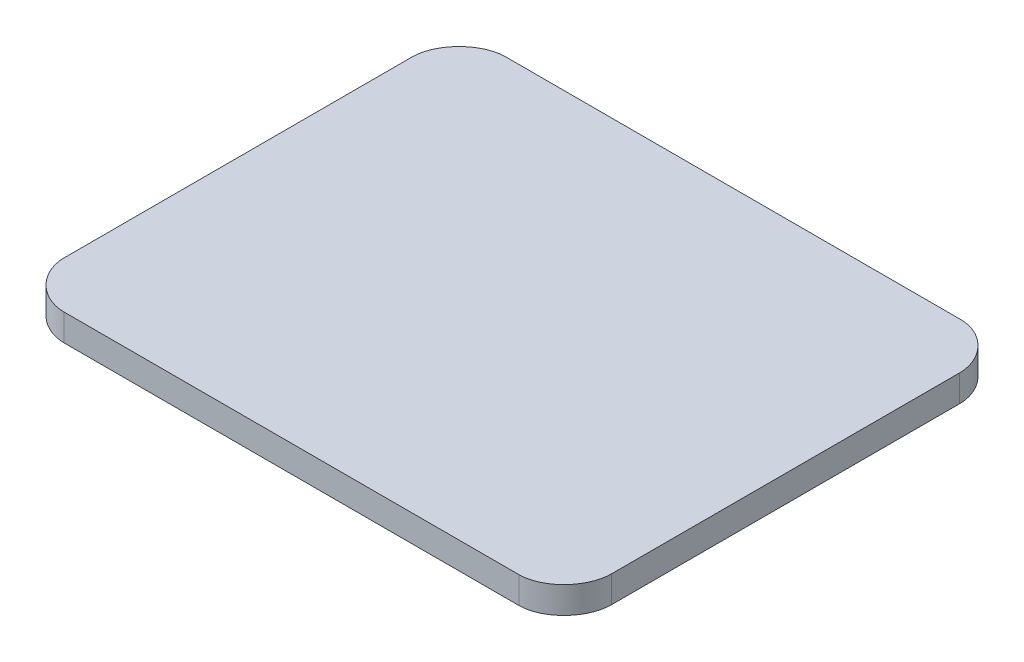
ISO-10303-21;
HEADER;
FILE_DESCRIPTION(('STEP AP214'),'2;1');
FILE_NAME('part.step','',(''),(''),'','','');
FILE_SCHEMA(('AUTOMOTIVE_DESIGN { 1 0 10303 214 1 1 1 1 }'));
ENDSEC;
DATA;
#1=APPLICATION_CONTEXT('core data for automotive mechanical design processes');
#2=APPLICATION_PROTOCOL_DEFINITION('international standard','automotive_design',2000,#1);
#3=PRODUCT_CONTEXT('',#1,'mechanical');
#4=PRODUCT('Part','Part','',(#3));
#5=PRODUCT_RELATED_PRODUCT_CATEGORY('part','',(#4));
#6=PRODUCT_DEFINITION_FORMATION('','',#4);
#7=PRODUCT_DEFINITION_CONTEXT('part definition',#1,'design');
#8=PRODUCT_DEFINITION('design','',#6,#7);
#9=PRODUCT_DEFINITION_SHAPE('','',#8);
#10=(LENGTH_UNIT() NAMED_UNIT(*) SI_UNIT(.MILLI.,.METRE.));
#11=(NAMED_UNIT(*) PLANE_ANGLE_UNIT() SI_UNIT($,.RADIAN.));
#12=(NAMED_UNIT(*) SI_UNIT($,.STERADIAN.) SOLID_ANGLE_UNIT());
#13=UNCERTAINTY_MEASURE_WITH_UNIT(LENGTH_MEASURE(1.E-05),#10,'distance_accuracy_value','');
#14=(GEOMETRIC_REPRESENTATION_CONTEXT(3) GLOBAL_UNCERTAINTY_ASSIGNED_CONTEXT((#13)) GLOBAL_UNIT_ASSIGNED_CONTEXT((#10,
#11,#12)) REPRESENTATION_CONTEXT('',''));
#15=CARTESIAN_POINT('',(0.,0.,0.));
#16=DIRECTION('',(0.,0.,1.));
#17=DIRECTION('',(1.,0.,0.));
#18=AXIS2_PLACEMENT_3D('',#15,#16,#17);
#19=CARTESIAN_POINT('',(-137.,-36.999,-42.4815439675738));
#20=CARTESIAN_POINT('',(-138.817475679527,-36.999,-42.4815439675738));
#21=CARTESIAN_POINT('',(-140.51763192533,-36.999,-44.1822833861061));
#22=CARTESIAN_POINT('',(-140.517631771,-36.999,-46.0005617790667));
#23=B_SPLINE_CURVE_WITH_KNOTS('',3,(#19,#20,#21,#22),.UNSPECIFIED.,.F.,.F.,(4,4),(0.,1.),.UNSPECIFIED.);
#24=DIRECTION('',(0.,-1.,0.));
#25=VECTOR('',#24,1.);
#26=SURFACE_OF_LINEAR_EXTRUSION('',#23,#25);
#27=CARTESIAN_POINT('',(-137.,-38.999,-42.4815439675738));
#28=CARTESIAN_POINT('',(-138.817475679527,-38.999,-42.4815439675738));
#29=CARTESIAN_POINT('',(-140.51763192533,-38.999,-44.1822833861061));
#30=CARTESIAN_POINT('',(-140.517631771,-38.999,-46.0005617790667));
#31=B_SPLINE_CURVE_WITH_KNOTS('',3,(#27,#28,#29,#30),.UNSPECIFIED.,.F.,.F.,(4,4),(0.,1.),.UNSPECIFIED.);
#32=CARTESIAN_POINT('',(-137.,-38.999,-42.4815439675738));
#33=VERTEX_POINT('',#32);
#34=CARTESIAN_POINT('',(-140.517631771,-38.999,-46.0005617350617));
#35=VERTEX_POINT('',#34);
#36=EDGE_CURVE('E256',#33,#35,#31,.T.);
#37=ORIENTED_EDGE('',*,*,#36,.F.);
#38=CARTESIAN_POINT('',(-137.,-38.999,-42.4815439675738));
#39=DIRECTION('',(0.,1.,0.));
#40=VECTOR('',#39,1.);
#41=LINE('',#38,#40);
#42=CARTESIAN_POINT('',(-137.,-36.999,-42.4815439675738));
#43=VERTEX_POINT('',#42);
#44=EDGE_CURVE('E37',#43,#33,#41,.F.);
#45=ORIENTED_EDGE('',*,*,#44,.F.);
#46=CARTESIAN_POINT('',(-140.517631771,-36.999,-46.0005617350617));
#47=VERTEX_POINT('',#46);
#48=EDGE_CURVE('E257',#43,#47,#23,.T.);
#49=ORIENTED_EDGE('',*,*,#48,.T.);
#50=CARTESIAN_POINT('',(-140.517631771,-36.999,-46.0005617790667));
#51=DIRECTION('',(0.,-1.,0.));
#52=VECTOR('',#51,1.);
#53=LINE('',#50,#52);
#54=EDGE_CURVE('E11',#47,#35,#53,.T.);
#55=ORIENTED_EDGE('',*,*,#54,.T.);
#56=EDGE_LOOP('',(#37,#45,#49,#55));
#57=FACE_BOUND('',#56,.T.);
#58=ADVANCED_FACE('F17',(#57),#26,.T.);
#59=CARTESIAN_POINT('',(-140.517631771,-36.999,-46.0005617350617));
#60=DIRECTION('',(-1.,0.,0.));
#61=DIRECTION('',(0.,0.,1.));
#62=AXIS2_PLACEMENT_3D('',#59,#60,#61);
#63=PLANE('',#62);
#64=DIRECTION('',(0.,0.,-1.));
#65=VECTOR('',#64,1.);
#66=CARTESIAN_POINT('',(-140.517631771,-38.999,-46.0005617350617));
#67=LINE('',#66,#65);
#68=CARTESIAN_POINT('',(-140.517631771,-38.999,-71.9994377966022));
#69=VERTEX_POINT('',#68);
#70=EDGE_CURVE('E259',#35,#69,#67,.T.);
#71=ORIENTED_EDGE('',*,*,#70,.F.);
#72=ORIENTED_EDGE('',*,*,#54,.F.);
#73=DIRECTION('',(0.,0.,-1.));
#74=VECTOR('',#73,1.);
#75=CARTESIAN_POINT('',(-140.517631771,-36.999,-46.0005617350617));
#76=LINE('',#75,#74);
#77=CARTESIAN_POINT('',(-140.517631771,-36.999,-71.9994377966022));
#78=VERTEX_POINT('',#77);
#79=EDGE_CURVE('E333',#47,#78,#76,.T.);
#80=ORIENTED_EDGE('',*,*,#79,.T.);
#81=CARTESIAN_POINT('',(-140.517631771,-38.999,-71.9994377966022));
#82=DIRECTION('',(0.,1.,0.));
#83=VECTOR('',#82,1.);
#84=LINE('',#81,#83);
#85=EDGE_CURVE('E29',#78,#69,#84,.F.);
#86=ORIENTED_EDGE('',*,*,#85,.T.);
#87=EDGE_LOOP('',(#71,#72,#80,#86));
#88=FACE_BOUND('',#87,.T.);
#89=ADVANCED_FACE('F220',(#88),#63,.T.);
#90=CARTESIAN_POINT('',(-140.517631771,-36.999,-71.9994377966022));
#91=CARTESIAN_POINT('',(-140.517631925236,-36.999,-73.8166049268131));
#92=CARTESIAN_POINT('',(-138.818587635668,-36.999,-75.518456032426));
#93=CARTESIAN_POINT('',(-137.,-36.999,-75.518456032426));
#94=B_SPLINE_CURVE_WITH_KNOTS('',3,(#90,#91,#92,#93),.UNSPECIFIED.,.F.,.F.,(4,4),(0.,1.),.UNSPECIFIED.);
#95=DIRECTION('',(0.,-1.,0.));
#96=VECTOR('',#95,1.);
#97=SURFACE_OF_LINEAR_EXTRUSION('',#94,#96);
#98=CARTESIAN_POINT('',(-140.517631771,-38.999,-71.9994377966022));
#99=CARTESIAN_POINT('',(-140.517631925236,-38.999,-73.8166049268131));
#100=CARTESIAN_POINT('',(-138.818587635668,-38.999,-75.518456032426));
#101=CARTESIAN_POINT('',(-137.,-38.999,-75.518456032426));
#102=B_SPLINE_CURVE_WITH_KNOTS('',3,(#98,#99,#100,#101),.UNSPECIFIED.,.F.,.F.,(4,4),(0.,1.),.UNSPECIFIED.);
#103=CARTESIAN_POINT('',(-137.,-38.999,-75.518456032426));
#104=VERTEX_POINT('',#103);
#105=EDGE_CURVE('E262',#69,#104,#102,.T.);
#106=ORIENTED_EDGE('',*,*,#105,.F.);
#107=ORIENTED_EDGE('',*,*,#85,.F.);
#108=CARTESIAN_POINT('',(-137.,-36.999,-75.518456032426));
#109=VERTEX_POINT('',#108);
#110=EDGE_CURVE('E207',#78,#109,#94,.T.);
#111=ORIENTED_EDGE('',*,*,#110,.T.);
#112=CARTESIAN_POINT('',(-137.,-36.999,-75.518456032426));
#113=DIRECTION('',(0.,-1.,0.));
#114=VECTOR('',#113,1.);
#115=LINE('',#112,#114);
#116=EDGE_CURVE('E328',#109,#104,#115,.T.);
#117=ORIENTED_EDGE('',*,*,#116,.T.);
#118=EDGE_LOOP('',(#106,#107,#111,#117));
#119=FACE_BOUND('',#118,.T.);
#120=ADVANCED_FACE('F217',(#119),#97,.T.);
#121=CARTESIAN_POINT('',(-137.,-36.999,-75.518456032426));
#122=DIRECTION('',(0.,0.,-1.));
#123=DIRECTION('',(-1.,0.,0.));
#124=AXIS2_PLACEMENT_3D('',#121,#122,#123);
#125=PLANE('',#124);
#126=DIRECTION('',(1.,0.,0.));
#127=VECTOR('',#126,1.);
#128=CARTESIAN_POINT('',(-137.,-38.999,-75.518456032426));
#129=LINE('',#128,#127);
#130=CARTESIAN_POINT('',(-103.,-38.999,-75.518456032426));
#131=VERTEX_POINT('',#130);
#132=EDGE_CURVE('E279',#104,#131,#129,.T.);
#133=ORIENTED_EDGE('',*,*,#132,.F.);
#134=ORIENTED_EDGE('',*,*,#116,.F.);
#135=DIRECTION('',(1.,0.,0.));
#136=VECTOR('',#135,1.);
#137=CARTESIAN_POINT('',(-137.,-36.999,-75.518456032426));
#138=LINE('',#137,#136);
#139=CARTESIAN_POINT('',(-103.,-36.999,-75.518456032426));
#140=VERTEX_POINT('',#139);
#141=EDGE_CURVE('E202',#109,#140,#138,.T.);
#142=ORIENTED_EDGE('',*,*,#141,.T.);
#143=CARTESIAN_POINT('',(-103.,-38.999,-75.518456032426));
#144=DIRECTION('',(0.,1.,0.));
#145=VECTOR('',#144,1.);
#146=LINE('',#143,#145);
#147=EDGE_CURVE('E325',#140,#131,#146,.F.);
#148=ORIENTED_EDGE('',*,*,#147,.T.);
#149=EDGE_LOOP('',(#133,#134,#142,#148));
#150=FACE_BOUND('',#149,.T.);
#151=ADVANCED_FACE('F189',(#150),#125,.T.);
#152=CARTESIAN_POINT('',(-103.,-36.999,-75.518456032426));
#153=CARTESIAN_POINT('',(-101.21026020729,-36.999,-75.518456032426));
#154=CARTESIAN_POINT('',(-99.5883466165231,-36.999,-73.7927007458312));
#155=CARTESIAN_POINT('',(-99.5884209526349,-36.999,-72.0198513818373));
#156=B_SPLINE_CURVE_WITH_KNOTS('',3,(#152,#153,#154,#155),.UNSPECIFIED.,.F.,.F.,(4,4),(0.,1.),.UNSPECIFIED.);
#157=DIRECTION('',(0.,-1.,0.));
#158=VECTOR('',#157,1.);
#159=SURFACE_OF_LINEAR_EXTRUSION('',#156,#158);
#160=CARTESIAN_POINT('',(-103.,-38.999,-75.518456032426));
#161=CARTESIAN_POINT('',(-101.21026020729,-38.999,-75.518456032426));
#162=CARTESIAN_POINT('',(-99.5883466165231,-38.999,-73.7927007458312));
#163=CARTESIAN_POINT('',(-99.5884209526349,-38.999,-72.0198513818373));
#164=B_SPLINE_CURVE_WITH_KNOTS('',3,(#160,#161,#162,#163),.UNSPECIFIED.,.F.,.F.,(4,4),(0.,1.),.UNSPECIFIED.);
#165=CARTESIAN_POINT('',(-99.5884209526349,-38.999,-72.0198513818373));
#166=VERTEX_POINT('',#165);
#167=EDGE_CURVE('E289',#131,#166,#164,.T.);
#168=ORIENTED_EDGE('',*,*,#167,.F.);
#169=ORIENTED_EDGE('',*,*,#147,.F.);
#170=CARTESIAN_POINT('',(-99.5884209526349,-36.999,-72.0198513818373));
#171=VERTEX_POINT('',#170);
#172=EDGE_CURVE('E116',#140,#171,#156,.T.);
#173=ORIENTED_EDGE('',*,*,#172,.T.);
#174=CARTESIAN_POINT('',(-99.5884209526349,-36.999,-72.0198513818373));
#175=DIRECTION('',(0.,-1.,0.));
#176=VECTOR('',#175,1.);
#177=LINE('',#174,#176);
#178=EDGE_CURVE('E106',#171,#166,#177,.T.);
#179=ORIENTED_EDGE('',*,*,#178,.T.);
#180=EDGE_LOOP('',(#168,#169,#173,#179));
#181=FACE_BOUND('',#180,.T.);
#182=ADVANCED_FACE('F179',(#181),#159,.T.);
#183=CARTESIAN_POINT('',(-99.5884209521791,-36.999,-72.0198731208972));
#184=DIRECTION('',(1.,0.,-7.94415164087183E-11));
#185=DIRECTION('',(-7.94415164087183E-11,0.,-1.));
#186=AXIS2_PLACEMENT_3D('',#183,#184,#185);
#187=PLANE('',#186);
#188=DIRECTION('',(7.94415164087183E-11,0.,1.));
#189=VECTOR('',#188,1.);
#190=CARTESIAN_POINT('',(-99.5884209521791,-38.999,-72.0198731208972));
#191=LINE('',#190,#189);
#192=CARTESIAN_POINT('',(-99.5884209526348,-38.999,-45.9801486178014));
#193=VERTEX_POINT('',#192);
#194=EDGE_CURVE('E294',#166,#193,#191,.T.);
#195=ORIENTED_EDGE('',*,*,#194,.F.);
#196=ORIENTED_EDGE('',*,*,#178,.F.);
#197=DIRECTION('',(7.94415164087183E-11,0.,1.));
#198=VECTOR('',#197,1.);
#199=CARTESIAN_POINT('',(-99.5884209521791,-36.999,-72.0198731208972));
#200=LINE('',#199,#198);
#201=CARTESIAN_POINT('',(-99.5884209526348,-36.999,-45.9801486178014));
#202=VERTEX_POINT('',#201);
#203=EDGE_CURVE('E110',#171,#202,#200,.T.);
#204=ORIENTED_EDGE('',*,*,#203,.T.);
#205=CARTESIAN_POINT('',(-99.5884209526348,-38.999,-45.9801486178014));
#206=DIRECTION('',(0.,1.,0.));
#207=VECTOR('',#206,1.);
#208=LINE('',#205,#207);
#209=EDGE_CURVE('E93',#202,#193,#208,.F.);
#210=ORIENTED_EDGE('',*,*,#209,.T.);
#211=EDGE_LOOP('',(#195,#196,#204,#210));
#212=FACE_BOUND('',#211,.T.);
#213=ADVANCED_FACE('F111',(#212),#187,.T.);
#214=CARTESIAN_POINT('',(-99.5884209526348,-36.999,-45.9801486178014));
#215=CARTESIAN_POINT('',(-99.5883466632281,-36.999,-44.2084131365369));
#216=CARTESIAN_POINT('',(-101.209196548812,-36.999,-42.4815439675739));
#217=CARTESIAN_POINT('',(-103.,-36.999,-42.4815439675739));
#218=B_SPLINE_CURVE_WITH_KNOTS('',3,(#214,#215,#216,#217),.UNSPECIFIED.,.F.,.F.,(4,4),(0.,1.),.UNSPECIFIED.);
#219=DIRECTION('',(0.,-1.,0.));
#220=VECTOR('',#219,1.);
#221=SURFACE_OF_LINEAR_EXTRUSION('',#218,#220);
#222=CARTESIAN_POINT('',(-99.5884209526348,-38.999,-45.9801486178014));
#223=CARTESIAN_POINT('',(-99.5883466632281,-38.999,-44.2084131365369));
#224=CARTESIAN_POINT('',(-101.209196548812,-38.999,-42.4815439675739));
#225=CARTESIAN_POINT('',(-103.,-38.999,-42.4815439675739));
#226=B_SPLINE_CURVE_WITH_KNOTS('',3,(#222,#223,#224,#225),.UNSPECIFIED.,.F.,.F.,(4,4),(0.,1.),.UNSPECIFIED.);
#227=CARTESIAN_POINT('',(-103.,-38.999,-42.4815439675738));
#228=VERTEX_POINT('',#227);
#229=EDGE_CURVE('E101',#193,#228,#226,.T.);
#230=ORIENTED_EDGE('',*,*,#229,.F.);
#231=ORIENTED_EDGE('',*,*,#209,.F.);
#232=CARTESIAN_POINT('',(-103.,-36.999,-42.4815439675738));
#233=VERTEX_POINT('',#232);
#234=EDGE_CURVE('E98',#202,#233,#218,.T.);
#235=ORIENTED_EDGE('',*,*,#234,.T.);
#236=CARTESIAN_POINT('',(-103.,-36.999,-42.4815439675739));
#237=DIRECTION('',(0.,-1.,0.));
#238=VECTOR('',#237,1.);
#239=LINE('',#236,#238);
#240=EDGE_CURVE('E66',#233,#228,#239,.T.);
#241=ORIENTED_EDGE('',*,*,#240,.T.);
#242=EDGE_LOOP('',(#230,#231,#235,#241));
#243=FACE_BOUND('',#242,.T.);
#244=ADVANCED_FACE('F96',(#243),#221,.T.);
#245=CARTESIAN_POINT('',(-103.,-36.999,-42.4815439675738));
#246=DIRECTION('',(0.,0.,1.));
#247=DIRECTION('',(1.,0.,0.));
#248=AXIS2_PLACEMENT_3D('',#245,#246,#247);
#249=PLANE('',#248);
#250=DIRECTION('',(-1.,0.,0.));
#251=VECTOR('',#250,1.);
#252=CARTESIAN_POINT('',(-103.,-38.999,-42.4815439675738));
#253=LINE('',#252,#251);
#254=EDGE_CURVE('E265',#228,#33,#253,.T.);
#255=ORIENTED_EDGE('',*,*,#254,.F.);
#256=ORIENTED_EDGE('',*,*,#240,.F.);
#257=DIRECTION('',(-1.,0.,0.));
#258=VECTOR('',#257,1.);
#259=CARTESIAN_POINT('',(-103.,-36.999,-42.4815439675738));
#260=LINE('',#259,#258);
#261=EDGE_CURVE('E120',#233,#43,#260,.T.);
#262=ORIENTED_EDGE('',*,*,#261,.T.);
#263=ORIENTED_EDGE('',*,*,#44,.T.);
#264=EDGE_LOOP('',(#255,#256,#262,#263));
#265=FACE_BOUND('',#264,.T.);
#266=ADVANCED_FACE('F139',(#265),#249,.T.);
#267=CARTESIAN_POINT('',(-120.,-36.999,-74.9999999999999));
#268=DIRECTION('',(0.,-1.,0.));
#269=DIRECTION('',(1.,0.,0.));
#270=AXIS2_PLACEMENT_3D('',#267,#268,#269);
#271=PLANE('',#270);
#272=ORIENTED_EDGE('',*,*,#48,.F.);
#273=ORIENTED_EDGE('',*,*,#261,.F.);
#274=ORIENTED_EDGE('',*,*,#234,.F.);
#275=ORIENTED_EDGE('',*,*,#203,.F.);
#276=ORIENTED_EDGE('',*,*,#172,.F.);
#277=ORIENTED_EDGE('',*,*,#141,.F.);
#278=ORIENTED_EDGE('',*,*,#110,.F.);
#279=ORIENTED_EDGE('',*,*,#79,.F.);
#280=EDGE_LOOP('',(#272,#273,#274,#275,#276,#277,#278,#279));
#281=FACE_BOUND('',#280,.T.);
#282=ADVANCED_FACE('F119',(#281),#271,.F.);
#283=CARTESIAN_POINT('',(-120.,-38.999,-74.9999999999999));
#284=DIRECTION('',(0.,-1.,0.));
#285=DIRECTION('',(1.,0.,0.));
#286=AXIS2_PLACEMENT_3D('',#283,#284,#285);
#287=PLANE('',#286);
#288=ORIENTED_EDGE('',*,*,#36,.T.);
#289=ORIENTED_EDGE('',*,*,#70,.T.);
#290=ORIENTED_EDGE('',*,*,#105,.T.);
#291=ORIENTED_EDGE('',*,*,#132,.T.);
#292=ORIENTED_EDGE('',*,*,#167,.T.);
#293=ORIENTED_EDGE('',*,*,#194,.T.);
#294=ORIENTED_EDGE('',*,*,#229,.T.);
#295=ORIENTED_EDGE('',*,*,#254,.T.);
#296=EDGE_LOOP('',(#288,#289,#290,#291,#292,#293,#294,#295));
#297=FACE_BOUND('',#296,.T.);
#298=ADVANCED_FACE('F264',(#297),#287,.T.);
#299=CLOSED_SHELL('',(#58,#89,#120,#151,#182,#213,#244,#266,#282,#298));
#300=MANIFOLD_SOLID_BREP('B1',#299);
#301=ADVANCED_BREP_SHAPE_REPRESENTATION('',(#18,#300),#14);
#302=SHAPE_DEFINITION_REPRESENTATION(#9,#301);
ENDSEC;
END-ISO-10303-21;
